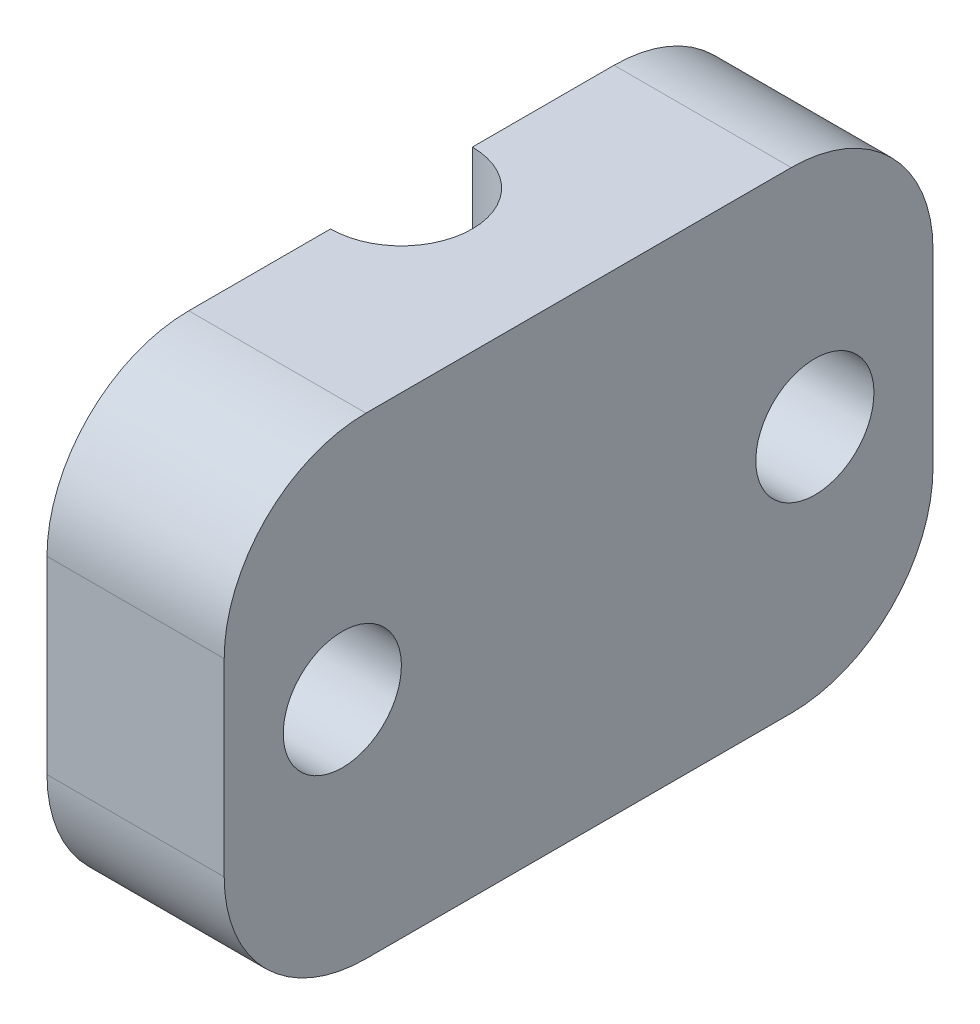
ISO-10303-21;
HEADER;
FILE_DESCRIPTION(('STEP AP214'),'2;1');
FILE_NAME('part.step','',(''),(''),'','','');
FILE_SCHEMA(('AUTOMOTIVE_DESIGN { 1 0 10303 214 1 1 1 1 }'));
ENDSEC;
DATA;
#1=APPLICATION_CONTEXT('core data for automotive mechanical design processes');
#2=APPLICATION_PROTOCOL_DEFINITION('international standard','automotive_design',2000,#1);
#3=PRODUCT_CONTEXT('',#1,'mechanical');
#4=PRODUCT('Part','Part','',(#3));
#5=PRODUCT_RELATED_PRODUCT_CATEGORY('part','',(#4));
#6=PRODUCT_DEFINITION_FORMATION('','',#4);
#7=PRODUCT_DEFINITION_CONTEXT('part definition',#1,'design');
#8=PRODUCT_DEFINITION('design','',#6,#7);
#9=PRODUCT_DEFINITION_SHAPE('','',#8);
#10=(LENGTH_UNIT() NAMED_UNIT(*) SI_UNIT(.MILLI.,.METRE.));
#11=(NAMED_UNIT(*) PLANE_ANGLE_UNIT() SI_UNIT($,.RADIAN.));
#12=(NAMED_UNIT(*) SI_UNIT($,.STERADIAN.) SOLID_ANGLE_UNIT());
#13=UNCERTAINTY_MEASURE_WITH_UNIT(LENGTH_MEASURE(1.E-05),#10,'distance_accuracy_value','');
#14=(GEOMETRIC_REPRESENTATION_CONTEXT(3) GLOBAL_UNCERTAINTY_ASSIGNED_CONTEXT((#13)) GLOBAL_UNIT_ASSIGNED_CONTEXT((#10,
#11,#12)) REPRESENTATION_CONTEXT('',''));
#15=CARTESIAN_POINT('',(0.,0.,0.));
#16=DIRECTION('',(0.,0.,1.));
#17=DIRECTION('',(1.,0.,0.));
#18=AXIS2_PLACEMENT_3D('',#15,#16,#17);
#19=CARTESIAN_POINT('',(-7.50000000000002,10.,15.));
#20=DIRECTION('',(0.,1.,0.));
#21=DIRECTION('',(-1.,0.,0.));
#22=AXIS2_PLACEMENT_3D('',#19,#20,#21);
#23=CYLINDRICAL_SURFACE('',#22,2.99999999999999);
#24=CARTESIAN_POINT('',(-7.50000000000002,12.,15.));
#25=DIRECTION('',(0.,-1.,0.));
#26=DIRECTION('',(1.,0.,0.));
#27=AXIS2_PLACEMENT_3D('',#24,#25,#26);
#28=CIRCLE('',#27,2.99999999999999);
#29=CARTESIAN_POINT('',(-7.5,12.,12.));
#30=VERTEX_POINT('',#29);
#31=CARTESIAN_POINT('',(-7.5,12.,18.));
#32=VERTEX_POINT('',#31);
#33=EDGE_CURVE('E210',#30,#32,#28,.T.);
#34=ORIENTED_EDGE('',*,*,#33,.T.);
#35=DIRECTION('',(0.,1.,0.));
#36=VECTOR('',#35,1.);
#37=CARTESIAN_POINT('',(-7.5,10.,18.));
#38=LINE('',#37,#36);
#39=CARTESIAN_POINT('',(-7.5,20.,18.));
#40=VERTEX_POINT('',#39);
#41=EDGE_CURVE('E240',#32,#40,#38,.T.);
#42=ORIENTED_EDGE('',*,*,#41,.T.);
#43=CARTESIAN_POINT('',(-7.50000000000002,20.,15.));
#44=DIRECTION('',(0.,-1.,0.));
#45=DIRECTION('',(1.,0.,0.));
#46=AXIS2_PLACEMENT_3D('',#43,#44,#45);
#47=CIRCLE('',#46,2.99999999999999);
#48=CARTESIAN_POINT('',(-7.5,20.,12.));
#49=VERTEX_POINT('',#48);
#50=EDGE_CURVE('E192',#49,#40,#47,.T.);
#51=ORIENTED_EDGE('',*,*,#50,.F.);
#52=DIRECTION('',(0.,1.,0.));
#53=VECTOR('',#52,1.);
#54=CARTESIAN_POINT('',(-7.5,10.,12.));
#55=LINE('',#54,#53);
#56=EDGE_CURVE('E254',#49,#30,#55,.F.);
#57=ORIENTED_EDGE('',*,*,#56,.T.);
#58=EDGE_LOOP('',(#34,#42,#51,#57));
#59=FACE_BOUND('',#58,.T.);
#60=ADVANCED_FACE('F44',(#59),#23,.F.);
#61=CARTESIAN_POINT('',(0.,20.,30.));
#62=DIRECTION('',(0.,-1.,0.));
#63=DIRECTION('',(1.,0.,0.));
#64=AXIS2_PLACEMENT_3D('',#61,#62,#63);
#65=PLANE('',#64);
#66=DIRECTION('',(0.,0.,-1.));
#67=VECTOR('',#66,1.);
#68=CARTESIAN_POINT('',(-7.5,20.,30.));
#69=LINE('',#68,#67);
#70=CARTESIAN_POINT('',(-7.5,20.,24.));
#71=VERTEX_POINT('',#70);
#72=EDGE_CURVE('E244',#71,#40,#69,.T.);
#73=ORIENTED_EDGE('',*,*,#72,.F.);
#74=DIRECTION('',(-1.,0.,0.));
#75=VECTOR('',#74,1.);
#76=CARTESIAN_POINT('',(0.,20.,24.));
#77=LINE('',#76,#75);
#78=CARTESIAN_POINT('',(0.,20.,24.));
#79=VERTEX_POINT('',#78);
#80=EDGE_CURVE('E169',#71,#79,#77,.F.);
#81=ORIENTED_EDGE('',*,*,#80,.T.);
#82=DIRECTION('',(0.,0.,-1.));
#83=VECTOR('',#82,1.);
#84=CARTESIAN_POINT('',(0.,20.,30.));
#85=LINE('',#84,#83);
#86=CARTESIAN_POINT('',(0.,20.,6.));
#87=VERTEX_POINT('',#86);
#88=EDGE_CURVE('E209',#79,#87,#85,.T.);
#89=ORIENTED_EDGE('',*,*,#88,.T.);
#90=DIRECTION('',(-1.,0.,0.));
#91=VECTOR('',#90,1.);
#92=CARTESIAN_POINT('',(0.,20.,6.));
#93=LINE('',#92,#91);
#94=CARTESIAN_POINT('',(-7.5,20.,6.));
#95=VERTEX_POINT('',#94);
#96=EDGE_CURVE('E160',#87,#95,#93,.T.);
#97=ORIENTED_EDGE('',*,*,#96,.T.);
#98=EDGE_CURVE('E258',#49,#95,#69,.T.);
#99=ORIENTED_EDGE('',*,*,#98,.F.);
#100=ORIENTED_EDGE('',*,*,#50,.T.);
#101=EDGE_LOOP('',(#73,#81,#89,#97,#99,#100));
#102=FACE_BOUND('',#101,.T.);
#103=ADVANCED_FACE('F312',(#102),#65,.F.);
#104=CARTESIAN_POINT('',(0.,0.,30.));
#105=DIRECTION('',(0.,1.,0.));
#106=DIRECTION('',(-1.,0.,0.));
#107=AXIS2_PLACEMENT_3D('',#104,#105,#106);
#108=PLANE('',#107);
#109=DIRECTION('',(0.,0.,1.));
#110=VECTOR('',#109,1.);
#111=CARTESIAN_POINT('',(-7.5,0.,30.));
#112=LINE('',#111,#110);
#113=CARTESIAN_POINT('',(-7.5,0.,6.));
#114=VERTEX_POINT('',#113);
#115=CARTESIAN_POINT('',(-7.5,0.,11.));
#116=VERTEX_POINT('',#115);
#117=EDGE_CURVE('E132',#114,#116,#112,.T.);
#118=ORIENTED_EDGE('',*,*,#117,.F.);
#119=DIRECTION('',(1.,0.,0.));
#120=VECTOR('',#119,1.);
#121=CARTESIAN_POINT('',(0.,0.,6.));
#122=LINE('',#121,#120);
#123=CARTESIAN_POINT('',(0.,0.,6.));
#124=VERTEX_POINT('',#123);
#125=EDGE_CURVE('E142',#114,#124,#122,.T.);
#126=ORIENTED_EDGE('',*,*,#125,.T.);
#127=DIRECTION('',(0.,0.,-1.));
#128=VECTOR('',#127,1.);
#129=CARTESIAN_POINT('',(0.,0.,30.));
#130=LINE('',#129,#128);
#131=CARTESIAN_POINT('',(0.,0.,24.));
#132=VERTEX_POINT('',#131);
#133=EDGE_CURVE('E217',#132,#124,#130,.T.);
#134=ORIENTED_EDGE('',*,*,#133,.F.);
#135=DIRECTION('',(1.,0.,0.));
#136=VECTOR('',#135,1.);
#137=CARTESIAN_POINT('',(-15.,0.,24.));
#138=LINE('',#137,#136);
#139=CARTESIAN_POINT('',(-7.5,0.,24.));
#140=VERTEX_POINT('',#139);
#141=EDGE_CURVE('E154',#132,#140,#138,.F.);
#142=ORIENTED_EDGE('',*,*,#141,.T.);
#143=CARTESIAN_POINT('',(-7.5,0.,19.));
#144=VERTEX_POINT('',#143);
#145=EDGE_CURVE('E150',#144,#140,#112,.T.);
#146=ORIENTED_EDGE('',*,*,#145,.F.);
#147=CARTESIAN_POINT('',(-7.5,0.,15.));
#148=DIRECTION('',(0.,1.,0.));
#149=DIRECTION('',(-1.,0.,0.));
#150=AXIS2_PLACEMENT_3D('',#147,#148,#149);
#151=CIRCLE('',#150,4.);
#152=EDGE_CURVE('E146',#144,#116,#151,.T.);
#153=ORIENTED_EDGE('',*,*,#152,.T.);
#154=EDGE_LOOP('',(#118,#126,#134,#142,#146,#153));
#155=FACE_BOUND('',#154,.T.);
#156=ADVANCED_FACE('F140',(#155),#108,.F.);
#157=CARTESIAN_POINT('',(0.,0.,30.));
#158=DIRECTION('',(0.,0.,1.));
#159=DIRECTION('',(1.,0.,0.));
#160=AXIS2_PLACEMENT_3D('',#157,#158,#159);
#161=PLANE('',#160);
#162=DIRECTION('',(-1.,0.,0.));
#163=VECTOR('',#162,1.);
#164=CARTESIAN_POINT('',(-15.,14.,30.));
#165=LINE('',#164,#163);
#166=CARTESIAN_POINT('',(0.,14.,30.));
#167=VERTEX_POINT('',#166);
#168=CARTESIAN_POINT('',(-7.5,14.,30.));
#169=VERTEX_POINT('',#168);
#170=EDGE_CURVE('E205',#167,#169,#165,.T.);
#171=ORIENTED_EDGE('',*,*,#170,.T.);
#172=DIRECTION('',(0.,-1.,0.));
#173=VECTOR('',#172,1.);
#174=CARTESIAN_POINT('',(-7.5,0.,30.));
#175=LINE('',#174,#173);
#176=CARTESIAN_POINT('',(-7.5,6.,30.));
#177=VERTEX_POINT('',#176);
#178=EDGE_CURVE('E60',#169,#177,#175,.T.);
#179=ORIENTED_EDGE('',*,*,#178,.T.);
#180=DIRECTION('',(1.,0.,0.));
#181=VECTOR('',#180,1.);
#182=CARTESIAN_POINT('',(0.,6.,30.));
#183=LINE('',#182,#181);
#184=CARTESIAN_POINT('',(0.,6.,30.));
#185=VERTEX_POINT('',#184);
#186=EDGE_CURVE('E200',#177,#185,#183,.T.);
#187=ORIENTED_EDGE('',*,*,#186,.T.);
#188=DIRECTION('',(0.,1.,0.));
#189=VECTOR('',#188,1.);
#190=CARTESIAN_POINT('',(0.,0.,30.));
#191=LINE('',#190,#189);
#192=EDGE_CURVE('E191',#185,#167,#191,.T.);
#193=ORIENTED_EDGE('',*,*,#192,.T.);
#194=EDGE_LOOP('',(#171,#179,#187,#193));
#195=FACE_BOUND('',#194,.T.);
#196=ADVANCED_FACE('F306',(#195),#161,.T.);
#197=CARTESIAN_POINT('',(0.,0.,0.));
#198=DIRECTION('',(0.,0.,1.));
#199=DIRECTION('',(1.,0.,0.));
#200=AXIS2_PLACEMENT_3D('',#197,#198,#199);
#201=PLANE('',#200);
#202=DIRECTION('',(0.,-1.,0.));
#203=VECTOR('',#202,1.);
#204=CARTESIAN_POINT('',(-7.5,0.,0.));
#205=LINE('',#204,#203);
#206=CARTESIAN_POINT('',(-7.5,14.,0.));
#207=VERTEX_POINT('',#206);
#208=CARTESIAN_POINT('',(-7.5,6.,0.));
#209=VERTEX_POINT('',#208);
#210=EDGE_CURVE('E68',#207,#209,#205,.T.);
#211=ORIENTED_EDGE('',*,*,#210,.F.);
#212=DIRECTION('',(-1.,0.,0.));
#213=VECTOR('',#212,1.);
#214=CARTESIAN_POINT('',(0.,14.,0.));
#215=LINE('',#214,#213);
#216=CARTESIAN_POINT('',(0.,14.,0.));
#217=VERTEX_POINT('',#216);
#218=EDGE_CURVE('E53',#207,#217,#215,.F.);
#219=ORIENTED_EDGE('',*,*,#218,.T.);
#220=DIRECTION('',(0.,1.,0.));
#221=VECTOR('',#220,1.);
#222=CARTESIAN_POINT('',(0.,0.,0.));
#223=LINE('',#222,#221);
#224=CARTESIAN_POINT('',(0.,6.,0.));
#225=VERTEX_POINT('',#224);
#226=EDGE_CURVE('E180',#225,#217,#223,.T.);
#227=ORIENTED_EDGE('',*,*,#226,.F.);
#228=DIRECTION('',(1.,0.,0.));
#229=VECTOR('',#228,1.);
#230=CARTESIAN_POINT('',(0.,6.,0.));
#231=LINE('',#230,#229);
#232=EDGE_CURVE('E172',#225,#209,#231,.F.);
#233=ORIENTED_EDGE('',*,*,#232,.T.);
#234=EDGE_LOOP('',(#211,#219,#227,#233));
#235=FACE_BOUND('',#234,.T.);
#236=ADVANCED_FACE('F179',(#235),#201,.F.);
#237=CARTESIAN_POINT('',(-7.5,31.3137084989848,15.));
#238=DIRECTION('',(0.,-1.,0.));
#239=DIRECTION('',(1.,0.,0.));
#240=AXIS2_PLACEMENT_3D('',#237,#238,#239);
#241=CYLINDRICAL_SURFACE('',#240,4.);
#242=CARTESIAN_POINT('',(-7.5,12.,15.));
#243=DIRECTION('',(0.,-1.,0.));
#244=DIRECTION('',(1.,0.,0.));
#245=AXIS2_PLACEMENT_3D('',#242,#243,#244);
#246=CIRCLE('',#245,4.);
#247=CARTESIAN_POINT('',(-7.5,12.,11.));
#248=VERTEX_POINT('',#247);
#249=CARTESIAN_POINT('',(-7.5,12.,19.));
#250=VERTEX_POINT('',#249);
#251=EDGE_CURVE('E214',#248,#250,#246,.T.);
#252=ORIENTED_EDGE('',*,*,#251,.F.);
#253=DIRECTION('',(0.,-1.,0.));
#254=VECTOR('',#253,1.);
#255=CARTESIAN_POINT('',(-7.5,31.3137084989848,11.));
#256=LINE('',#255,#254);
#257=EDGE_CURVE('E261',#248,#116,#256,.T.);
#258=ORIENTED_EDGE('',*,*,#257,.T.);
#259=ORIENTED_EDGE('',*,*,#152,.F.);
#260=DIRECTION('',(0.,-1.,0.));
#261=VECTOR('',#260,1.);
#262=CARTESIAN_POINT('',(-7.5,31.3137084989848,19.));
#263=LINE('',#262,#261);
#264=EDGE_CURVE('E231',#144,#250,#263,.F.);
#265=ORIENTED_EDGE('',*,*,#264,.T.);
#266=EDGE_LOOP('',(#252,#258,#259,#265));
#267=FACE_BOUND('',#266,.T.);
#268=ADVANCED_FACE('F324',(#267),#241,.F.);
#269=CARTESIAN_POINT('',(0.,12.,30.));
#270=DIRECTION('',(0.,-1.,0.));
#271=DIRECTION('',(1.,0.,0.));
#272=AXIS2_PLACEMENT_3D('',#269,#270,#271);
#273=PLANE('',#272);
#274=ORIENTED_EDGE('',*,*,#251,.T.);
#275=DIRECTION('',(0.,0.,-1.));
#276=VECTOR('',#275,1.);
#277=CARTESIAN_POINT('',(-7.5,12.,30.));
#278=LINE('',#277,#276);
#279=EDGE_CURVE('E235',#250,#32,#278,.T.);
#280=ORIENTED_EDGE('',*,*,#279,.T.);
#281=ORIENTED_EDGE('',*,*,#33,.F.);
#282=EDGE_CURVE('E250',#30,#248,#278,.T.);
#283=ORIENTED_EDGE('',*,*,#282,.T.);
#284=EDGE_LOOP('',(#274,#280,#281,#283));
#285=FACE_BOUND('',#284,.T.);
#286=ADVANCED_FACE('F320',(#285),#273,.T.);
#287=CARTESIAN_POINT('',(0.,6.,24.));
#288=DIRECTION('',(-1.,0.,0.));
#289=DIRECTION('',(0.,-1.,0.));
#290=AXIS2_PLACEMENT_3D('',#287,#288,#289);
#291=CYLINDRICAL_SURFACE('',#290,6.);
#292=ORIENTED_EDGE('',*,*,#186,.F.);
#293=CARTESIAN_POINT('',(-7.5,6.,24.));
#294=DIRECTION('',(-1.,0.,0.));
#295=DIRECTION('',(0.,-1.,0.));
#296=AXIS2_PLACEMENT_3D('',#293,#294,#295);
#297=CIRCLE('',#296,6.);
#298=EDGE_CURVE('E236',#177,#140,#297,.F.);
#299=ORIENTED_EDGE('',*,*,#298,.T.);
#300=ORIENTED_EDGE('',*,*,#141,.F.);
#301=CARTESIAN_POINT('',(0.,6.,24.));
#302=DIRECTION('',(-1.,0.,0.));
#303=DIRECTION('',(0.,-1.,0.));
#304=AXIS2_PLACEMENT_3D('',#301,#302,#303);
#305=CIRCLE('',#304,6.);
#306=EDGE_CURVE('E155',#185,#132,#305,.F.);
#307=ORIENTED_EDGE('',*,*,#306,.F.);
#308=EDGE_LOOP('',(#292,#299,#300,#307));
#309=FACE_BOUND('',#308,.T.);
#310=ADVANCED_FACE('F301',(#309),#291,.T.);
#311=CARTESIAN_POINT('',(0.,14.,24.));
#312=DIRECTION('',(1.,0.,0.));
#313=DIRECTION('',(0.,1.,0.));
#314=AXIS2_PLACEMENT_3D('',#311,#312,#313);
#315=CYLINDRICAL_SURFACE('',#314,6.);
#316=ORIENTED_EDGE('',*,*,#80,.F.);
#317=CARTESIAN_POINT('',(-7.5,14.,24.));
#318=DIRECTION('',(-1.,0.,0.));
#319=DIRECTION('',(0.,-1.,0.));
#320=AXIS2_PLACEMENT_3D('',#317,#318,#319);
#321=CIRCLE('',#320,6.);
#322=EDGE_CURVE('E247',#71,#169,#321,.F.);
#323=ORIENTED_EDGE('',*,*,#322,.T.);
#324=ORIENTED_EDGE('',*,*,#170,.F.);
#325=CARTESIAN_POINT('',(0.,14.,24.));
#326=DIRECTION('',(-1.,0.,0.));
#327=DIRECTION('',(0.,-1.,0.));
#328=AXIS2_PLACEMENT_3D('',#325,#326,#327);
#329=CIRCLE('',#328,6.);
#330=EDGE_CURVE('E162',#79,#167,#329,.F.);
#331=ORIENTED_EDGE('',*,*,#330,.F.);
#332=EDGE_LOOP('',(#316,#323,#324,#331));
#333=FACE_BOUND('',#332,.T.);
#334=ADVANCED_FACE('F309',(#333),#315,.T.);
#335=CARTESIAN_POINT('',(0.,14.,6.));
#336=DIRECTION('',(-1.,0.,0.));
#337=DIRECTION('',(0.,-1.,0.));
#338=AXIS2_PLACEMENT_3D('',#335,#336,#337);
#339=CYLINDRICAL_SURFACE('',#338,6.);
#340=ORIENTED_EDGE('',*,*,#218,.F.);
#341=CARTESIAN_POINT('',(-7.5,14.,6.));
#342=DIRECTION('',(-1.,0.,0.));
#343=DIRECTION('',(0.,-1.,0.));
#344=AXIS2_PLACEMENT_3D('',#341,#342,#343);
#345=CIRCLE('',#344,6.);
#346=EDGE_CURVE('E148',#207,#95,#345,.F.);
#347=ORIENTED_EDGE('',*,*,#346,.T.);
#348=ORIENTED_EDGE('',*,*,#96,.F.);
#349=CARTESIAN_POINT('',(0.,14.,6.));
#350=DIRECTION('',(-1.,0.,0.));
#351=DIRECTION('',(0.,-1.,0.));
#352=AXIS2_PLACEMENT_3D('',#349,#350,#351);
#353=CIRCLE('',#352,6.);
#354=EDGE_CURVE('E188',#217,#87,#353,.F.);
#355=ORIENTED_EDGE('',*,*,#354,.F.);
#356=EDGE_LOOP('',(#340,#347,#348,#355));
#357=FACE_BOUND('',#356,.T.);
#358=ADVANCED_FACE('F195',(#357),#339,.T.);
#359=CARTESIAN_POINT('',(0.,6.,6.));
#360=DIRECTION('',(1.,0.,0.));
#361=DIRECTION('',(0.,1.,0.));
#362=AXIS2_PLACEMENT_3D('',#359,#360,#361);
#363=CYLINDRICAL_SURFACE('',#362,6.);
#364=ORIENTED_EDGE('',*,*,#125,.F.);
#365=CARTESIAN_POINT('',(-7.5,6.,6.));
#366=DIRECTION('',(-1.,0.,0.));
#367=DIRECTION('',(0.,-1.,0.));
#368=AXIS2_PLACEMENT_3D('',#365,#366,#367);
#369=CIRCLE('',#368,6.);
#370=EDGE_CURVE('E12',#114,#209,#369,.F.);
#371=ORIENTED_EDGE('',*,*,#370,.T.);
#372=ORIENTED_EDGE('',*,*,#232,.F.);
#373=CARTESIAN_POINT('',(0.,6.,6.));
#374=DIRECTION('',(-1.,0.,0.));
#375=DIRECTION('',(0.,-1.,0.));
#376=AXIS2_PLACEMENT_3D('',#373,#374,#375);
#377=CIRCLE('',#376,6.);
#378=EDGE_CURVE('E151',#124,#225,#377,.F.);
#379=ORIENTED_EDGE('',*,*,#378,.F.);
#380=EDGE_LOOP('',(#364,#371,#372,#379));
#381=FACE_BOUND('',#380,.T.);
#382=ADVANCED_FACE('F46',(#381),#363,.T.);
#383=CARTESIAN_POINT('',(0.,0.,30.));
#384=DIRECTION('',(-1.,0.,0.));
#385=DIRECTION('',(0.,-1.,0.));
#386=AXIS2_PLACEMENT_3D('',#383,#384,#385);
#387=PLANE('',#386);
#388=CARTESIAN_POINT('',(0.,10.,25.));
#389=DIRECTION('',(-1.,0.,0.));
#390=DIRECTION('',(0.,-1.,0.));
#391=AXIS2_PLACEMENT_3D('',#388,#389,#390);
#392=CIRCLE('',#391,2.5);
#393=CARTESIAN_POINT('',(0.,7.5,25.));
#394=VERTEX_POINT('',#393);
#395=EDGE_CURVE('E268',#394,#394,#392,.T.);
#396=ORIENTED_EDGE('',*,*,#395,.T.);
#397=EDGE_LOOP('',(#396));
#398=FACE_BOUND('',#397,.T.);
#399=CARTESIAN_POINT('',(0.,10.,5.));
#400=DIRECTION('',(-1.,0.,0.));
#401=DIRECTION('',(0.,-1.,0.));
#402=AXIS2_PLACEMENT_3D('',#399,#400,#401);
#403=CIRCLE('',#402,2.5);
#404=CARTESIAN_POINT('',(0.,7.5,5.));
#405=VERTEX_POINT('',#404);
#406=EDGE_CURVE('E269',#405,#405,#403,.T.);
#407=ORIENTED_EDGE('',*,*,#406,.T.);
#408=EDGE_LOOP('',(#407));
#409=FACE_BOUND('',#408,.T.);
#410=ORIENTED_EDGE('',*,*,#192,.F.);
#411=ORIENTED_EDGE('',*,*,#306,.T.);
#412=ORIENTED_EDGE('',*,*,#133,.T.);
#413=ORIENTED_EDGE('',*,*,#378,.T.);
#414=ORIENTED_EDGE('',*,*,#226,.T.);
#415=ORIENTED_EDGE('',*,*,#354,.T.);
#416=ORIENTED_EDGE('',*,*,#88,.F.);
#417=ORIENTED_EDGE('',*,*,#330,.T.);
#418=EDGE_LOOP('',(#410,#411,#412,#413,#414,#415,#416,#417));
#419=FACE_BOUND('',#418,.T.);
#420=ADVANCED_FACE('F186',(#398,#409,#419),#387,.F.);
#421=CARTESIAN_POINT('',(-7.5,0.,0.));
#422=DIRECTION('',(-1.,0.,0.));
#423=DIRECTION('',(0.,-1.,0.));
#424=AXIS2_PLACEMENT_3D('',#421,#422,#423);
#425=PLANE('',#424);
#426=CARTESIAN_POINT('',(-7.5,10.,5.));
#427=DIRECTION('',(-1.,0.,0.));
#428=DIRECTION('',(0.,-1.,0.));
#429=AXIS2_PLACEMENT_3D('',#426,#427,#428);
#430=CIRCLE('',#429,2.5);
#431=CARTESIAN_POINT('',(-7.5,7.5,5.));
#432=VERTEX_POINT('',#431);
#433=EDGE_CURVE('E273',#432,#432,#430,.T.);
#434=ORIENTED_EDGE('',*,*,#433,.F.);
#435=EDGE_LOOP('',(#434));
#436=FACE_BOUND('',#435,.T.);
#437=ORIENTED_EDGE('',*,*,#56,.F.);
#438=ORIENTED_EDGE('',*,*,#98,.T.);
#439=ORIENTED_EDGE('',*,*,#346,.F.);
#440=ORIENTED_EDGE('',*,*,#210,.T.);
#441=ORIENTED_EDGE('',*,*,#370,.F.);
#442=ORIENTED_EDGE('',*,*,#117,.T.);
#443=ORIENTED_EDGE('',*,*,#257,.F.);
#444=ORIENTED_EDGE('',*,*,#282,.F.);
#445=EDGE_LOOP('',(#437,#438,#439,#440,#441,#442,#443,#444));
#446=FACE_BOUND('',#445,.T.);
#447=ADVANCED_FACE('F131',(#436,#446),#425,.T.);
#448=CARTESIAN_POINT('',(-7.5,10.,25.));
#449=DIRECTION('',(-1.,0.,0.));
#450=DIRECTION('',(0.,-1.,0.));
#451=AXIS2_PLACEMENT_3D('',#448,#449,#450);
#452=CIRCLE('',#451,2.5);
#453=CARTESIAN_POINT('',(-7.5,7.5,25.));
#454=VERTEX_POINT('',#453);
#455=EDGE_CURVE('E277',#454,#454,#452,.T.);
#456=ORIENTED_EDGE('',*,*,#455,.F.);
#457=EDGE_LOOP('',(#456));
#458=FACE_BOUND('',#457,.T.);
#459=ORIENTED_EDGE('',*,*,#145,.T.);
#460=ORIENTED_EDGE('',*,*,#298,.F.);
#461=ORIENTED_EDGE('',*,*,#178,.F.);
#462=ORIENTED_EDGE('',*,*,#322,.F.);
#463=ORIENTED_EDGE('',*,*,#72,.T.);
#464=ORIENTED_EDGE('',*,*,#41,.F.);
#465=ORIENTED_EDGE('',*,*,#279,.F.);
#466=ORIENTED_EDGE('',*,*,#264,.F.);
#467=EDGE_LOOP('',(#459,#460,#461,#462,#463,#464,#465,#466));
#468=FACE_BOUND('',#467,.T.);
#469=ADVANCED_FACE('F291',(#458,#468),#425,.T.);
#470=CARTESIAN_POINT('',(0.,10.,25.));
#471=DIRECTION('',(-1.,0.,0.));
#472=DIRECTION('',(0.,-1.,0.));
#473=AXIS2_PLACEMENT_3D('',#470,#471,#472);
#474=CYLINDRICAL_SURFACE('',#473,2.5);
#475=ORIENTED_EDGE('',*,*,#395,.F.);
#476=EDGE_LOOP('',(#475));
#477=FACE_BOUND('',#476,.T.);
#478=ORIENTED_EDGE('',*,*,#455,.T.);
#479=EDGE_LOOP('',(#478));
#480=FACE_BOUND('',#479,.T.);
#481=ADVANCED_FACE('F287',(#477,#480),#474,.F.);
#482=CARTESIAN_POINT('',(0.,10.,5.));
#483=DIRECTION('',(-1.,0.,0.));
#484=DIRECTION('',(0.,-1.,0.));
#485=AXIS2_PLACEMENT_3D('',#482,#483,#484);
#486=CYLINDRICAL_SURFACE('',#485,2.5);
#487=ORIENTED_EDGE('',*,*,#406,.F.);
#488=EDGE_LOOP('',(#487));
#489=FACE_BOUND('',#488,.T.);
#490=ORIENTED_EDGE('',*,*,#433,.T.);
#491=EDGE_LOOP('',(#490));
#492=FACE_BOUND('',#491,.T.);
#493=ADVANCED_FACE('F290',(#489,#492),#486,.F.);
#494=CLOSED_SHELL('',(#60,#103,#156,#196,#236,#268,#286,#310,#334,#358,#382,#420,#447,#469,#481,#493));
#495=MANIFOLD_SOLID_BREP('B2',#494);
#496=ADVANCED_BREP_SHAPE_REPRESENTATION('',(#18,#495),#14);
#497=SHAPE_DEFINITION_REPRESENTATION(#9,#496);
ENDSEC;
END-ISO-10303-21;
